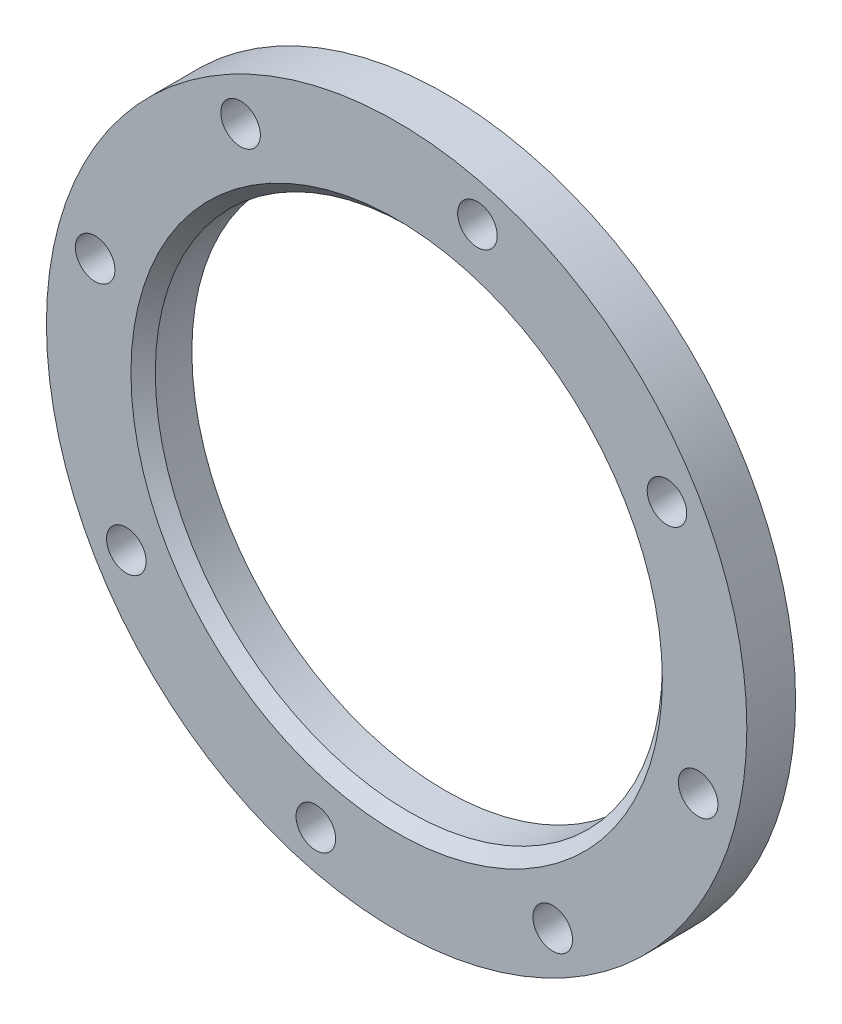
from build123d import *

# Parameters (mm, degrees)
SKETCH1_R          = 230
SKETCH1_R_2        = 166.5
EXTRUDE1_DEPTH     = 32
CHAMFER1_SIZE      = 8
SKETCH2_R          = 13
CUT_EXTRUDE1_DEPTH = 327.839410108
CIRPATTERN1_COUNT  = 8


with BuildPart() as part:
    # Sketch1 → Extrude1 (new body)
    with BuildSketch(Plane.XY):
        Circle(SKETCH1_R)
        Circle(SKETCH1_R_2, mode=Mode.SUBTRACT)
    extrude(amount=EXTRUDE1_DEPTH)

    # Chamfer1
    chamfer1_edges = [part.edges().sort_by_distance(p)[0] for p in [
        (-166.5, 0, 32),
    ]]
    chamfer(chamfer1_edges, length=CHAMFER1_SIZE)

    # Sketch2 → Cut-Extrude1 (cut, through all)
    with BuildSketch(Plane.XY.offset(32)):
        with Locations((53.057904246, 198.014794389)):
            Circle(SKETCH2_R)
    cut_extrude1 = extrude(amount=-CUT_EXTRUDE1_DEPTH, mode=Mode.SUBTRACT)

    # CirPattern1: Cut-Extrude1 ×8 about axis
    cirpattern1_axis = Axis((0, 0, 0), (0, 0, 1))
    for i in range(1, CIRPATTERN1_COUNT):
        add(cut_extrude1.rotate(cirpattern1_axis, i * 360 / CIRPATTERN1_COUNT), mode=Mode.SUBTRACT)


solid = part.part
